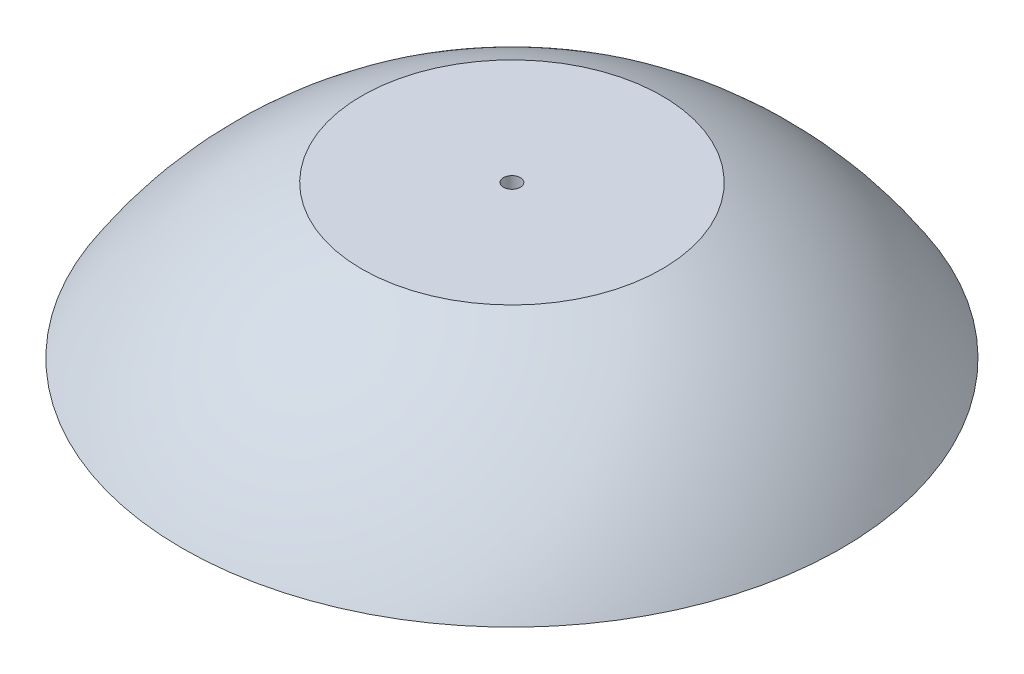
from build123d import *

# Parameters (mm, degrees)
SKETCH4_R               = 2.4892
CUT_EXTRUDE2_DEPTH      = 158.450550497
BOSS_EXTRUDE1_START     = 49.774680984
SKETCH5_R               = 31.75
SKETCH5_R_2             = 2.4892
BOSS_EXTRUDE1_DEPTH     = 49.774680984
CUT_EXTRUDE3_DEPTH      = 157.916893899
CUT_EXTRUDE3_DEPTH_BACK = 157.916893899
SKETCH6_W               = 248.261297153
SKETCH6_H               = 13.666215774


with BuildPart() as part:
    # Sketch2 → Revolve1 (revolve)
    with BuildSketch(Plane(origin=(0, 0, 0), x_dir=(0, 0, -1), z_dir=(1, 0, 0)), mode=Mode.PRIVATE) as revolve1_sk:
        with BuildLine():
            Line((-39.739995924, 41.835132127), (-51.258600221, 41.835132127))
            ThreePointArc((-51.258600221, 41.835132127), (-52.381132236, 41.370164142), (-52.846100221, 40.247632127))
            Line((-52.846100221, 40.247632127), (-52.846100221, 37.072632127))
            ThreePointArc((-52.846100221, 37.072632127), (-53.311068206, 35.950100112), (-54.433600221, 35.485132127))
            Line((-54.433600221, 35.485132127), (-61.995319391, 35.485132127))
            ThreePointArc((-61.995319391, 35.485132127), (-63.117851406, 35.020164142), (-63.582819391, 33.897632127))
            Line((-63.582819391, 33.897632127), (-63.582819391, 30.722632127))
            ThreePointArc((-63.582819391, 30.722632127), (-64.047787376, 29.600100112), (-65.170319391, 29.135132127))
            Line((-65.170319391, 29.135132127), (-70.584010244, 29.135132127))
            ThreePointArc((-70.584010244, 29.135132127), (-71.706542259, 28.670164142), (-72.171510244, 27.547632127))
            Line((-72.171510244, 27.547632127), (-72.171510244, 24.372632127))
            ThreePointArc((-72.171510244, 24.372632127), (-72.636478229, 23.250100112), (-73.759010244, 22.785132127))
            Line((-73.759010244, 22.785132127), (-77.732796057, 22.785132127))
            ThreePointArc((-77.732796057, 22.785132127), (-78.855328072, 22.320164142), (-79.320296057, 21.197632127))
            Line((-79.320296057, 21.197632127), (-79.320296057, 18.022632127))
            ThreePointArc((-79.320296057, 18.022632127), (-79.785264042, 16.900100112), (-80.907796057, 16.435132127))
            Line((-80.907796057, 16.435132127), (-83.807540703, 16.435132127))
            ThreePointArc((-83.807540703, 16.435132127), (-84.930072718, 15.970164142), (-85.395040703, 14.847632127))
            Line((-85.395040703, 14.847632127), (-85.395040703, 11.672632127))
            ThreePointArc((-85.395040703, 11.672632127), (-85.860008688, 10.550100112), (-86.982540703, 10.085132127))
            Line((-86.982540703, 10.085132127), (-89.026461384, 10.085132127))
            ThreePointArc((-89.026461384, 10.085132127), (-90.148993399, 9.620164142), (-90.613961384, 8.497632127))
            Line((-90.613961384, 8.497632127), (-90.613961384, 3.735132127))
            Line((-90.613961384, 3.735132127), (-90.613961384, -0.002048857))
            ThreePointArc((-90.613961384, -0.002048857), (-91.078929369, -1.124580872), (-92.201461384, -1.589548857))
            Line((-92.201461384, -1.589548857), (-103.897136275, -1.589548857))
            ThreePointArc((-103.897136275, -1.589548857), (-79.376863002, 32.235193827), (-44.397961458, 55.07886835))
            Line((-44.397961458, 55.07886835), (0, 55.07886835))
            Line((0, 55.07886835), (0, 48.185132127))
            Line((0, 48.185132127), (-36.564995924, 48.185132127))
            ThreePointArc((-36.564995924, 48.185132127), (-37.687527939, 47.720164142), (-38.152495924, 46.597632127))
            Line((-38.152495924, 46.597632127), (-38.152495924, 43.422632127))
            ThreePointArc((-38.152495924, 43.422632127), (-38.617463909, 42.300100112), (-39.739995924, 41.835132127))
        make_face()
    revolve(revolve1_sk.sketch.rotate(Axis((0, 0, 0), (0, 1, 0)), 180), axis=Axis((0, 0, 0), (0, 1, 0)))

    # Sketch4 → Cut-Extrude2 (cut, through all)
    with BuildSketch(Plane.XZ.offset(1.502453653)):
        with Locations(Location((0, 0, 0), (0, 0, 270))):
            Circle(SKETCH4_R)
    extrude(amount=-CUT_EXTRUDE2_DEPTH, mode=Mode.SUBTRACT)

    # Sketch5 → Boss-Extrude1 (add)
    with BuildSketch(Plane.XZ.offset(-48.185132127).offset(BOSS_EXTRUDE1_START)):
        with Locations(Location((0, 0, 0), (0, 0, 90))):
            Circle(SKETCH5_R)
        with Locations(Location((0, 0, 0), (0, 0, 270))):
            Circle(SKETCH5_R_2, mode=Mode.SUBTRACT)
    extrude(amount=-BOSS_EXTRUDE1_DEPTH)

    # Sketch6 → Cut-Extrude3 (cut, two sides: drawn at the far end of the back side and taken through both)
    with BuildSketch(Plane.XY.offset(-CUT_EXTRUDE3_DEPTH_BACK)):
        with Locations((-5.894276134, 3.250515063)):
            Rectangle(SKETCH6_W, SKETCH6_H)
    extrude(amount=CUT_EXTRUDE3_DEPTH + CUT_EXTRUDE3_DEPTH_BACK, mode=Mode.SUBTRACT)


solid = part.part
